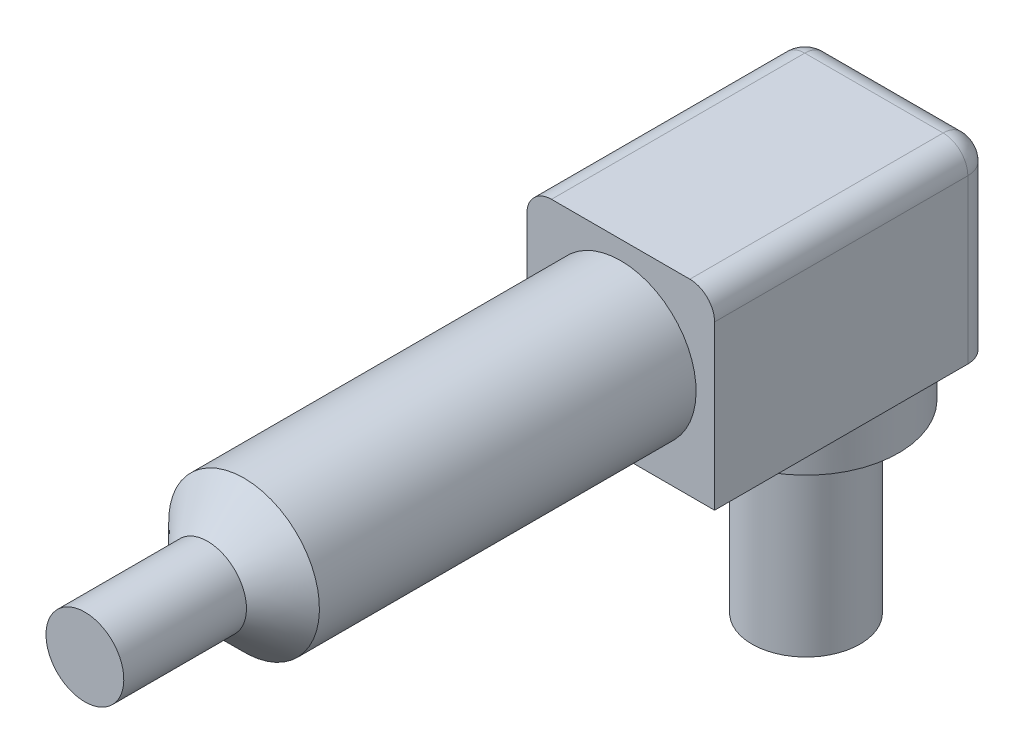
ISO-10303-21;
HEADER;
FILE_DESCRIPTION(('STEP AP214'),'2;1');
FILE_NAME('part.step','',(''),(''),'','','');
FILE_SCHEMA(('AUTOMOTIVE_DESIGN { 1 0 10303 214 1 1 1 1 }'));
ENDSEC;
DATA;
#1=APPLICATION_CONTEXT('core data for automotive mechanical design processes');
#2=APPLICATION_PROTOCOL_DEFINITION('international standard','automotive_design',2000,#1);
#3=PRODUCT_CONTEXT('',#1,'mechanical');
#4=PRODUCT('Part','Part','',(#3));
#5=PRODUCT_RELATED_PRODUCT_CATEGORY('part','',(#4));
#6=PRODUCT_DEFINITION_FORMATION('','',#4);
#7=PRODUCT_DEFINITION_CONTEXT('part definition',#1,'design');
#8=PRODUCT_DEFINITION('design','',#6,#7);
#9=PRODUCT_DEFINITION_SHAPE('','',#8);
#10=(LENGTH_UNIT() NAMED_UNIT(*) SI_UNIT(.MILLI.,.METRE.));
#11=(NAMED_UNIT(*) PLANE_ANGLE_UNIT() SI_UNIT($,.RADIAN.));
#12=(NAMED_UNIT(*) SI_UNIT($,.STERADIAN.) SOLID_ANGLE_UNIT());
#13=UNCERTAINTY_MEASURE_WITH_UNIT(LENGTH_MEASURE(1.E-05),#10,'distance_accuracy_value','');
#14=(GEOMETRIC_REPRESENTATION_CONTEXT(3) GLOBAL_UNCERTAINTY_ASSIGNED_CONTEXT((#13)) GLOBAL_UNIT_ASSIGNED_CONTEXT((#10,
#11,#12)) REPRESENTATION_CONTEXT('',''));
#15=CARTESIAN_POINT('',(0.,0.,0.));
#16=DIRECTION('',(0.,0.,1.));
#17=DIRECTION('',(1.,0.,0.));
#18=AXIS2_PLACEMENT_3D('',#15,#16,#17);
#19=CARTESIAN_POINT('',(9.652,-9.652,28.575));
#20=DIRECTION('',(-1.,0.,0.));
#21=DIRECTION('',(0.,0.,1.));
#22=AXIS2_PLACEMENT_3D('',#19,#20,#21);
#23=PLANE('',#22);
#24=DIRECTION('',(0.,0.,-1.));
#25=VECTOR('',#24,1.);
#26=CARTESIAN_POINT('',(9.652,-9.652,28.575));
#27=LINE('',#26,#25);
#28=CARTESIAN_POINT('',(9.652,-9.652,28.575));
#29=VERTEX_POINT('',#28);
#30=CARTESIAN_POINT('',(9.652,-9.652,2.54));
#31=VERTEX_POINT('',#30);
#32=EDGE_CURVE('E125',#29,#31,#27,.T.);
#33=ORIENTED_EDGE('',*,*,#32,.T.);
#34=DIRECTION('',(0.,1.,0.));
#35=VECTOR('',#34,1.);
#36=CARTESIAN_POINT('',(9.652,9.652,2.54));
#37=LINE('',#36,#35);
#38=CARTESIAN_POINT('',(9.652,7.112,2.54));
#39=VERTEX_POINT('',#38);
#40=EDGE_CURVE('E11',#31,#39,#37,.T.);
#41=ORIENTED_EDGE('',*,*,#40,.T.);
#42=DIRECTION('',(0.,0.,-1.));
#43=VECTOR('',#42,1.);
#44=CARTESIAN_POINT('',(9.652,7.112,28.575));
#45=LINE('',#44,#43);
#46=CARTESIAN_POINT('',(9.652,7.112,28.575));
#47=VERTEX_POINT('',#46);
#48=EDGE_CURVE('E43',#39,#47,#45,.F.);
#49=ORIENTED_EDGE('',*,*,#48,.T.);
#50=DIRECTION('',(0.,1.,0.));
#51=VECTOR('',#50,1.);
#52=CARTESIAN_POINT('',(9.652,-9.652,28.575));
#53=LINE('',#52,#51);
#54=EDGE_CURVE('E134',#29,#47,#53,.T.);
#55=ORIENTED_EDGE('',*,*,#54,.F.);
#56=EDGE_LOOP('',(#33,#41,#49,#55));
#57=FACE_BOUND('',#56,.T.);
#58=ADVANCED_FACE('F34',(#57),#23,.F.);
#59=CARTESIAN_POINT('',(-9.652,9.652,28.575));
#60=DIRECTION('',(0.,-1.,0.));
#61=DIRECTION('',(0.,0.,-1.));
#62=AXIS2_PLACEMENT_3D('',#59,#60,#61);
#63=PLANE('',#62);
#64=DIRECTION('',(-1.,0.,0.));
#65=VECTOR('',#64,1.);
#66=CARTESIAN_POINT('',(-9.652,9.652,2.54));
#67=LINE('',#66,#65);
#68=CARTESIAN_POINT('',(7.112,9.652,2.54));
#69=VERTEX_POINT('',#68);
#70=CARTESIAN_POINT('',(-7.112,9.652,2.54));
#71=VERTEX_POINT('',#70);
#72=EDGE_CURVE('E142',#69,#71,#67,.T.);
#73=ORIENTED_EDGE('',*,*,#72,.T.);
#74=DIRECTION('',(0.,0.,-1.));
#75=VECTOR('',#74,1.);
#76=CARTESIAN_POINT('',(-7.112,9.652,28.575));
#77=LINE('',#76,#75);
#78=CARTESIAN_POINT('',(-7.112,9.652,28.575));
#79=VERTEX_POINT('',#78);
#80=EDGE_CURVE('E144',#71,#79,#77,.F.);
#81=ORIENTED_EDGE('',*,*,#80,.T.);
#82=DIRECTION('',(-1.,0.,0.));
#83=VECTOR('',#82,1.);
#84=CARTESIAN_POINT('',(-9.652,9.652,28.575));
#85=LINE('',#84,#83);
#86=CARTESIAN_POINT('',(7.112,9.652,28.575));
#87=VERTEX_POINT('',#86);
#88=EDGE_CURVE('E116',#87,#79,#85,.T.);
#89=ORIENTED_EDGE('',*,*,#88,.F.);
#90=DIRECTION('',(0.,0.,-1.));
#91=VECTOR('',#90,1.);
#92=CARTESIAN_POINT('',(7.112,9.652,28.575));
#93=LINE('',#92,#91);
#94=EDGE_CURVE('E140',#87,#69,#93,.T.);
#95=ORIENTED_EDGE('',*,*,#94,.T.);
#96=EDGE_LOOP('',(#73,#81,#89,#95));
#97=FACE_BOUND('',#96,.T.);
#98=ADVANCED_FACE('F237',(#97),#63,.F.);
#99=CARTESIAN_POINT('',(-9.652,-9.652,28.575));
#100=DIRECTION('',(1.,0.,0.));
#101=DIRECTION('',(0.,0.,-1.));
#102=AXIS2_PLACEMENT_3D('',#99,#100,#101);
#103=PLANE('',#102);
#104=DIRECTION('',(0.,-1.,0.));
#105=VECTOR('',#104,1.);
#106=CARTESIAN_POINT('',(-9.652,-9.652,28.575));
#107=LINE('',#106,#105);
#108=CARTESIAN_POINT('',(-9.652,7.112,28.575));
#109=VERTEX_POINT('',#108);
#110=CARTESIAN_POINT('',(-9.652,-9.652,28.575));
#111=VERTEX_POINT('',#110);
#112=EDGE_CURVE('E103',#109,#111,#107,.T.);
#113=ORIENTED_EDGE('',*,*,#112,.F.);
#114=DIRECTION('',(0.,0.,-1.));
#115=VECTOR('',#114,1.);
#116=CARTESIAN_POINT('',(-9.652,7.112,28.575));
#117=LINE('',#116,#115);
#118=CARTESIAN_POINT('',(-9.652,7.112,2.54));
#119=VERTEX_POINT('',#118);
#120=EDGE_CURVE('E138',#109,#119,#117,.T.);
#121=ORIENTED_EDGE('',*,*,#120,.T.);
#122=DIRECTION('',(0.,-1.,0.));
#123=VECTOR('',#122,1.);
#124=CARTESIAN_POINT('',(-9.652,-9.652,2.54));
#125=LINE('',#124,#123);
#126=CARTESIAN_POINT('',(-9.652,-9.652,2.54));
#127=VERTEX_POINT('',#126);
#128=EDGE_CURVE('E122',#119,#127,#125,.T.);
#129=ORIENTED_EDGE('',*,*,#128,.T.);
#130=DIRECTION('',(0.,0.,-1.));
#131=VECTOR('',#130,1.);
#132=CARTESIAN_POINT('',(-9.652,-9.652,28.575));
#133=LINE('',#132,#131);
#134=EDGE_CURVE('E119',#111,#127,#133,.T.);
#135=ORIENTED_EDGE('',*,*,#134,.F.);
#136=EDGE_LOOP('',(#113,#121,#129,#135));
#137=FACE_BOUND('',#136,.T.);
#138=ADVANCED_FACE('F120',(#137),#103,.F.);
#139=CARTESIAN_POINT('',(-9.652,-9.652,28.575));
#140=DIRECTION('',(0.,1.,0.));
#141=DIRECTION('',(0.,0.,1.));
#142=AXIS2_PLACEMENT_3D('',#139,#140,#141);
#143=PLANE('',#142);
#144=ORIENTED_EDGE('',*,*,#134,.T.);
#145=CARTESIAN_POINT('',(-7.112,-9.652,2.54));
#146=DIRECTION('',(0.,1.,0.));
#147=DIRECTION('',(0.,0.,1.));
#148=AXIS2_PLACEMENT_3D('',#145,#146,#147);
#149=CIRCLE('',#148,2.54);
#150=CARTESIAN_POINT('',(-7.112,-9.652,0.));
#151=VERTEX_POINT('',#150);
#152=EDGE_CURVE('E151',#127,#151,#149,.F.);
#153=ORIENTED_EDGE('',*,*,#152,.T.);
#154=DIRECTION('',(1.,0.,0.));
#155=VECTOR('',#154,1.);
#156=CARTESIAN_POINT('',(-9.652,-9.652,0.));
#157=LINE('',#156,#155);
#158=CARTESIAN_POINT('',(0.,-9.652,0.));
#159=VERTEX_POINT('',#158);
#160=EDGE_CURVE('E133',#151,#159,#157,.T.);
#161=ORIENTED_EDGE('',*,*,#160,.T.);
#162=CARTESIAN_POINT('',(0.,-9.652,9.525));
#163=DIRECTION('',(0.,1.,0.));
#164=DIRECTION('',(0.,0.,1.));
#165=AXIS2_PLACEMENT_3D('',#162,#163,#164);
#166=CIRCLE('',#165,9.525);
#167=EDGE_CURVE('E200',#159,#159,#166,.T.);
#168=ORIENTED_EDGE('',*,*,#167,.T.);
#169=CARTESIAN_POINT('',(7.112,-9.652,0.));
#170=VERTEX_POINT('',#169);
#171=EDGE_CURVE('E135',#159,#170,#157,.T.);
#172=ORIENTED_EDGE('',*,*,#171,.T.);
#173=CARTESIAN_POINT('',(7.112,-9.652,2.54));
#174=DIRECTION('',(0.,1.,0.));
#175=DIRECTION('',(0.,0.,1.));
#176=AXIS2_PLACEMENT_3D('',#173,#174,#175);
#177=CIRCLE('',#176,2.54);
#178=EDGE_CURVE('E149',#170,#31,#177,.F.);
#179=ORIENTED_EDGE('',*,*,#178,.T.);
#180=ORIENTED_EDGE('',*,*,#32,.F.);
#181=DIRECTION('',(1.,0.,0.));
#182=VECTOR('',#181,1.);
#183=CARTESIAN_POINT('',(-9.652,-9.652,28.575));
#184=LINE('',#183,#182);
#185=EDGE_CURVE('E109',#111,#29,#184,.T.);
#186=ORIENTED_EDGE('',*,*,#185,.F.);
#187=EDGE_LOOP('',(#144,#153,#161,#168,#172,#179,#180,#186));
#188=FACE_BOUND('',#187,.T.);
#189=ADVANCED_FACE('F127',(#188),#143,.F.);
#190=CARTESIAN_POINT('',(0.,0.,28.575));
#191=DIRECTION('',(0.,0.,-1.));
#192=DIRECTION('',(-1.,0.,0.));
#193=AXIS2_PLACEMENT_3D('',#190,#191,#192);
#194=PLANE('',#193);
#195=CARTESIAN_POINT('',(0.,0.,28.575));
#196=DIRECTION('',(0.,0.,-1.));
#197=DIRECTION('',(0.,1.,0.));
#198=AXIS2_PLACEMENT_3D('',#195,#196,#197);
#199=CIRCLE('',#198,7.74999999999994);
#200=CARTESIAN_POINT('',(0.,7.75,28.575));
#201=VERTEX_POINT('',#200);
#202=EDGE_CURVE('E188',#201,#201,#199,.T.);
#203=ORIENTED_EDGE('',*,*,#202,.T.);
#204=EDGE_LOOP('',(#203));
#205=FACE_BOUND('',#204,.T.);
#206=ORIENTED_EDGE('',*,*,#88,.T.);
#207=CARTESIAN_POINT('',(-7.112,7.112,28.575));
#208=DIRECTION('',(0.,0.,-1.));
#209=DIRECTION('',(-1.,0.,0.));
#210=AXIS2_PLACEMENT_3D('',#207,#208,#209);
#211=CIRCLE('',#210,2.54);
#212=EDGE_CURVE('E112',#79,#109,#211,.F.);
#213=ORIENTED_EDGE('',*,*,#212,.T.);
#214=ORIENTED_EDGE('',*,*,#112,.T.);
#215=ORIENTED_EDGE('',*,*,#185,.T.);
#216=ORIENTED_EDGE('',*,*,#54,.T.);
#217=CARTESIAN_POINT('',(7.112,7.112,28.575));
#218=DIRECTION('',(0.,0.,-1.));
#219=DIRECTION('',(-1.,0.,0.));
#220=AXIS2_PLACEMENT_3D('',#217,#218,#219);
#221=CIRCLE('',#220,2.54);
#222=EDGE_CURVE('E146',#47,#87,#221,.F.);
#223=ORIENTED_EDGE('',*,*,#222,.T.);
#224=EDGE_LOOP('',(#206,#213,#214,#215,#216,#223));
#225=FACE_BOUND('',#224,.T.);
#226=ADVANCED_FACE('F106',(#205,#225),#194,.F.);
#227=CARTESIAN_POINT('',(0.,0.,0.));
#228=DIRECTION('',(0.,0.,-1.));
#229=DIRECTION('',(-1.,0.,0.));
#230=AXIS2_PLACEMENT_3D('',#227,#228,#229);
#231=PLANE('',#230);
#232=ORIENTED_EDGE('',*,*,#160,.F.);
#233=DIRECTION('',(0.,-1.,0.));
#234=VECTOR('',#233,1.);
#235=CARTESIAN_POINT('',(-7.112,9.652,0.));
#236=LINE('',#235,#234);
#237=CARTESIAN_POINT('',(-7.112,7.112,0.));
#238=VERTEX_POINT('',#237);
#239=EDGE_CURVE('E57',#151,#238,#236,.F.);
#240=ORIENTED_EDGE('',*,*,#239,.T.);
#241=DIRECTION('',(-1.,0.,0.));
#242=VECTOR('',#241,1.);
#243=CARTESIAN_POINT('',(9.652,7.112,0.));
#244=LINE('',#243,#242);
#245=CARTESIAN_POINT('',(7.112,7.112,0.));
#246=VERTEX_POINT('',#245);
#247=EDGE_CURVE('E155',#238,#246,#244,.F.);
#248=ORIENTED_EDGE('',*,*,#247,.T.);
#249=DIRECTION('',(0.,1.,0.));
#250=VECTOR('',#249,1.);
#251=CARTESIAN_POINT('',(7.112,-9.652,0.));
#252=LINE('',#251,#250);
#253=EDGE_CURVE('E153',#246,#170,#252,.F.);
#254=ORIENTED_EDGE('',*,*,#253,.T.);
#255=ORIENTED_EDGE('',*,*,#171,.F.);
#256=EDGE_LOOP('',(#232,#240,#248,#254,#255));
#257=FACE_BOUND('',#256,.T.);
#258=ADVANCED_FACE('F219',(#257),#231,.T.);
#259=CARTESIAN_POINT('',(0.,-9.652,9.525));
#260=DIRECTION('',(0.,1.,0.));
#261=DIRECTION('',(0.,0.,1.));
#262=AXIS2_PLACEMENT_3D('',#259,#260,#261);
#263=CYLINDRICAL_SURFACE('',#262,9.525);
#264=ORIENTED_EDGE('',*,*,#167,.F.);
#265=EDGE_LOOP('',(#264));
#266=FACE_BOUND('',#265,.T.);
#267=CARTESIAN_POINT('',(0.,-14.148,9.525));
#268=DIRECTION('',(0.,1.,0.));
#269=DIRECTION('',(0.,0.,1.));
#270=AXIS2_PLACEMENT_3D('',#267,#268,#269);
#271=CIRCLE('',#270,9.525);
#272=CARTESIAN_POINT('',(0.,-14.148,19.05));
#273=VERTEX_POINT('',#272);
#274=EDGE_CURVE('E197',#273,#273,#271,.T.);
#275=ORIENTED_EDGE('',*,*,#274,.T.);
#276=EDGE_LOOP('',(#275));
#277=FACE_BOUND('',#276,.T.);
#278=ADVANCED_FACE('F357',(#266,#277),#263,.T.);
#279=CARTESIAN_POINT('',(0.,-14.148,0.));
#280=DIRECTION('',(0.,1.,0.));
#281=DIRECTION('',(0.,0.,1.));
#282=AXIS2_PLACEMENT_3D('',#279,#280,#281);
#283=PLANE('',#282);
#284=ORIENTED_EDGE('',*,*,#274,.F.);
#285=EDGE_LOOP('',(#284));
#286=FACE_BOUND('',#285,.T.);
#287=CARTESIAN_POINT('',(0.,-14.148,9.525));
#288=DIRECTION('',(0.,1.,0.));
#289=DIRECTION('',(0.,0.,1.));
#290=AXIS2_PLACEMENT_3D('',#287,#288,#289);
#291=CIRCLE('',#290,5.55625);
#292=CARTESIAN_POINT('',(0.,-14.148,15.08125));
#293=VERTEX_POINT('',#292);
#294=EDGE_CURVE('E194',#293,#293,#291,.T.);
#295=ORIENTED_EDGE('',*,*,#294,.T.);
#296=EDGE_LOOP('',(#295));
#297=FACE_BOUND('',#296,.T.);
#298=ADVANCED_FACE('F347',(#286,#297),#283,.F.);
#299=CARTESIAN_POINT('',(0.,-9.652,9.525));
#300=DIRECTION('',(0.,1.,0.));
#301=DIRECTION('',(0.,0.,1.));
#302=AXIS2_PLACEMENT_3D('',#299,#300,#301);
#303=CYLINDRICAL_SURFACE('',#302,5.55625);
#304=ORIENTED_EDGE('',*,*,#294,.F.);
#305=EDGE_LOOP('',(#304));
#306=FACE_BOUND('',#305,.T.);
#307=CARTESIAN_POINT('',(0.,-33.148,9.525));
#308=DIRECTION('',(0.,1.,0.));
#309=DIRECTION('',(0.,0.,1.));
#310=AXIS2_PLACEMENT_3D('',#307,#308,#309);
#311=CIRCLE('',#310,5.55625);
#312=CARTESIAN_POINT('',(0.,-33.148,15.08125));
#313=VERTEX_POINT('',#312);
#314=EDGE_CURVE('E191',#313,#313,#311,.T.);
#315=ORIENTED_EDGE('',*,*,#314,.T.);
#316=EDGE_LOOP('',(#315));
#317=FACE_BOUND('',#316,.T.);
#318=ADVANCED_FACE('F337',(#306,#317),#303,.T.);
#319=CARTESIAN_POINT('',(0.,-33.148,3.96875));
#320=DIRECTION('',(0.,1.,0.));
#321=DIRECTION('',(0.,0.,1.));
#322=AXIS2_PLACEMENT_3D('',#319,#320,#321);
#323=PLANE('',#322);
#324=ORIENTED_EDGE('',*,*,#314,.F.);
#325=EDGE_LOOP('',(#324));
#326=FACE_BOUND('',#325,.T.);
#327=ADVANCED_FACE('F325',(#326),#323,.F.);
#328=CARTESIAN_POINT('',(0.,0.,0.));
#329=DIRECTION('',(0.,0.,-1.));
#330=DIRECTION('',(0.,1.,0.));
#331=AXIS2_PLACEMENT_3D('',#328,#329,#330);
#332=CYLINDRICAL_SURFACE('',#331,7.74999999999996);
#333=CARTESIAN_POINT('',(0.,0.,67.3));
#334=DIRECTION('',(0.,0.,-1.));
#335=DIRECTION('',(0.,1.,0.));
#336=AXIS2_PLACEMENT_3D('',#333,#334,#335);
#337=CIRCLE('',#336,7.74999999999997);
#338=CARTESIAN_POINT('',(0.,7.74999999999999,67.3));
#339=VERTEX_POINT('',#338);
#340=EDGE_CURVE('E183',#339,#339,#337,.T.);
#341=ORIENTED_EDGE('',*,*,#340,.T.);
#342=EDGE_LOOP('',(#341));
#343=FACE_BOUND('',#342,.T.);
#344=ORIENTED_EDGE('',*,*,#202,.F.);
#345=EDGE_LOOP('',(#344));
#346=FACE_BOUND('',#345,.T.);
#347=ADVANCED_FACE('F316',(#343,#346),#332,.T.);
#348=CARTESIAN_POINT('',(0.,0.,67.3));
#349=DIRECTION('',(0.,0.,-1.));
#350=DIRECTION('',(0.,1.,0.));
#351=AXIS2_PLACEMENT_3D('',#348,#349,#350);
#352=CONICAL_SURFACE('',#351,7.74999999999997,0.785398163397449);
#353=CARTESIAN_POINT('',(0.,0.,71.05));
#354=DIRECTION('',(0.,0.,-1.));
#355=DIRECTION('',(0.,1.,0.));
#356=AXIS2_PLACEMENT_3D('',#353,#354,#355);
#357=CIRCLE('',#356,3.99999999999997);
#358=CARTESIAN_POINT('',(0.,3.99999999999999,71.05));
#359=VERTEX_POINT('',#358);
#360=EDGE_CURVE('E178',#359,#359,#357,.T.);
#361=ORIENTED_EDGE('',*,*,#360,.T.);
#362=EDGE_LOOP('',(#361));
#363=FACE_BOUND('',#362,.T.);
#364=ORIENTED_EDGE('',*,*,#340,.F.);
#365=EDGE_LOOP('',(#364));
#366=FACE_BOUND('',#365,.T.);
#367=ADVANCED_FACE('F308',(#363,#366),#352,.T.);
#368=CARTESIAN_POINT('',(0.,0.,0.));
#369=DIRECTION('',(0.,0.,-1.));
#370=DIRECTION('',(0.,1.,0.));
#371=AXIS2_PLACEMENT_3D('',#368,#369,#370);
#372=CYLINDRICAL_SURFACE('',#371,3.99999999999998);
#373=CARTESIAN_POINT('',(0.,0.,83.6612133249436));
#374=DIRECTION('',(0.,0.,-1.));
#375=DIRECTION('',(0.,1.,0.));
#376=AXIS2_PLACEMENT_3D('',#373,#374,#375);
#377=CIRCLE('',#376,3.99999999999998);
#378=CARTESIAN_POINT('',(0.,3.99999999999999,83.6612133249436));
#379=VERTEX_POINT('',#378);
#380=EDGE_CURVE('E175',#379,#379,#377,.T.);
#381=ORIENTED_EDGE('',*,*,#380,.T.);
#382=EDGE_LOOP('',(#381));
#383=FACE_BOUND('',#382,.T.);
#384=ORIENTED_EDGE('',*,*,#360,.F.);
#385=EDGE_LOOP('',(#384));
#386=FACE_BOUND('',#385,.T.);
#387=ADVANCED_FACE('F233',(#383,#386),#372,.T.);
#388=CARTESIAN_POINT('',(0.,3.99999999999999,83.6612133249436));
#389=DIRECTION('',(0.,0.,1.));
#390=DIRECTION('',(0.,-1.,0.));
#391=AXIS2_PLACEMENT_3D('',#388,#389,#390);
#392=PLANE('',#391);
#393=ORIENTED_EDGE('',*,*,#380,.F.);
#394=EDGE_LOOP('',(#393));
#395=FACE_BOUND('',#394,.T.);
#396=ADVANCED_FACE('F226',(#395),#392,.T.);
#397=CARTESIAN_POINT('',(7.112,-9.652,2.54));
#398=DIRECTION('',(0.,-1.,0.));
#399=DIRECTION('',(0.,0.,-1.));
#400=AXIS2_PLACEMENT_3D('',#397,#398,#399);
#401=CYLINDRICAL_SURFACE('',#400,2.54);
#402=ORIENTED_EDGE('',*,*,#178,.F.);
#403=ORIENTED_EDGE('',*,*,#253,.F.);
#404=CARTESIAN_POINT('',(7.112,7.112,2.54));
#405=DIRECTION('',(0.,1.,0.));
#406=DIRECTION('',(0.,0.,1.));
#407=AXIS2_PLACEMENT_3D('',#404,#405,#406);
#408=CIRCLE('',#407,2.54);
#409=EDGE_CURVE('E38',#39,#246,#408,.T.);
#410=ORIENTED_EDGE('',*,*,#409,.F.);
#411=ORIENTED_EDGE('',*,*,#40,.F.);
#412=EDGE_LOOP('',(#402,#403,#410,#411));
#413=FACE_BOUND('',#412,.T.);
#414=ADVANCED_FACE('F36',(#413),#401,.T.);
#415=CARTESIAN_POINT('',(7.112,7.112,28.575));
#416=DIRECTION('',(0.,0.,-1.));
#417=DIRECTION('',(-1.,0.,0.));
#418=AXIS2_PLACEMENT_3D('',#415,#416,#417);
#419=CYLINDRICAL_SURFACE('',#418,2.54);
#420=ORIENTED_EDGE('',*,*,#222,.F.);
#421=ORIENTED_EDGE('',*,*,#48,.F.);
#422=CARTESIAN_POINT('',(7.112,7.112,2.54));
#423=DIRECTION('',(0.,0.,-1.));
#424=DIRECTION('',(-1.,0.,0.));
#425=AXIS2_PLACEMENT_3D('',#422,#423,#424);
#426=CIRCLE('',#425,2.54);
#427=EDGE_CURVE('E169',#69,#39,#426,.T.);
#428=ORIENTED_EDGE('',*,*,#427,.F.);
#429=ORIENTED_EDGE('',*,*,#94,.F.);
#430=EDGE_LOOP('',(#420,#421,#428,#429));
#431=FACE_BOUND('',#430,.T.);
#432=ADVANCED_FACE('F225',(#431),#419,.T.);
#433=CARTESIAN_POINT('',(7.112,7.112,2.54));
#434=DIRECTION('',(0.,0.,1.));
#435=DIRECTION('',(1.,0.,0.));
#436=AXIS2_PLACEMENT_3D('',#433,#434,#435);
#437=SPHERICAL_SURFACE('',#436,2.54);
#438=ORIENTED_EDGE('',*,*,#427,.T.);
#439=ORIENTED_EDGE('',*,*,#409,.T.);
#440=CARTESIAN_POINT('',(7.112,7.112,2.54));
#441=DIRECTION('',(1.,0.,0.));
#442=DIRECTION('',(0.,0.,-1.));
#443=AXIS2_PLACEMENT_3D('',#440,#441,#442);
#444=CIRCLE('',#443,2.54);
#445=EDGE_CURVE('E167',#69,#246,#444,.F.);
#446=ORIENTED_EDGE('',*,*,#445,.F.);
#447=EDGE_LOOP('',(#438,#439,#446));
#448=FACE_BOUND('',#447,.T.);
#449=ADVANCED_FACE('F231',(#448),#437,.T.);
#450=CARTESIAN_POINT('',(-7.112,-9.652,2.54));
#451=DIRECTION('',(0.,1.,0.));
#452=DIRECTION('',(0.,0.,1.));
#453=AXIS2_PLACEMENT_3D('',#450,#451,#452);
#454=CYLINDRICAL_SURFACE('',#453,2.54);
#455=ORIENTED_EDGE('',*,*,#152,.F.);
#456=ORIENTED_EDGE('',*,*,#128,.F.);
#457=CARTESIAN_POINT('',(-7.112,7.112,2.54));
#458=DIRECTION('',(0.,1.,0.));
#459=DIRECTION('',(0.,0.,1.));
#460=AXIS2_PLACEMENT_3D('',#457,#458,#459);
#461=CIRCLE('',#460,2.54);
#462=EDGE_CURVE('E164',#238,#119,#461,.T.);
#463=ORIENTED_EDGE('',*,*,#462,.F.);
#464=ORIENTED_EDGE('',*,*,#239,.F.);
#465=EDGE_LOOP('',(#455,#456,#463,#464));
#466=FACE_BOUND('',#465,.T.);
#467=ADVANCED_FACE('F216',(#466),#454,.T.);
#468=CARTESIAN_POINT('',(-9.652,7.112,2.54));
#469=DIRECTION('',(1.,0.,0.));
#470=DIRECTION('',(0.,0.,-1.));
#471=AXIS2_PLACEMENT_3D('',#468,#469,#470);
#472=CYLINDRICAL_SURFACE('',#471,2.54);
#473=ORIENTED_EDGE('',*,*,#445,.T.);
#474=ORIENTED_EDGE('',*,*,#247,.F.);
#475=CARTESIAN_POINT('',(-7.112,7.112,2.54));
#476=DIRECTION('',(-1.,0.,0.));
#477=DIRECTION('',(0.,0.,1.));
#478=AXIS2_PLACEMENT_3D('',#475,#476,#477);
#479=CIRCLE('',#478,2.54);
#480=EDGE_CURVE('E161',#71,#238,#479,.T.);
#481=ORIENTED_EDGE('',*,*,#480,.F.);
#482=ORIENTED_EDGE('',*,*,#72,.F.);
#483=EDGE_LOOP('',(#473,#474,#481,#482));
#484=FACE_BOUND('',#483,.T.);
#485=ADVANCED_FACE('F249',(#484),#472,.T.);
#486=CARTESIAN_POINT('',(-7.112,7.112,2.54));
#487=DIRECTION('',(0.,0.,1.));
#488=DIRECTION('',(1.,0.,0.));
#489=AXIS2_PLACEMENT_3D('',#486,#487,#488);
#490=SPHERICAL_SURFACE('',#489,2.54);
#491=ORIENTED_EDGE('',*,*,#480,.T.);
#492=ORIENTED_EDGE('',*,*,#462,.T.);
#493=CARTESIAN_POINT('',(-7.112,7.112,2.54));
#494=DIRECTION('',(0.,0.,-1.));
#495=DIRECTION('',(-1.,0.,0.));
#496=AXIS2_PLACEMENT_3D('',#493,#494,#495);
#497=CIRCLE('',#496,2.54);
#498=EDGE_CURVE('E159',#71,#119,#497,.F.);
#499=ORIENTED_EDGE('',*,*,#498,.F.);
#500=EDGE_LOOP('',(#491,#492,#499));
#501=FACE_BOUND('',#500,.T.);
#502=ADVANCED_FACE('F213',(#501),#490,.T.);
#503=CARTESIAN_POINT('',(-7.112,7.112,28.575));
#504=DIRECTION('',(0.,0.,-1.));
#505=DIRECTION('',(-1.,0.,0.));
#506=AXIS2_PLACEMENT_3D('',#503,#504,#505);
#507=CYLINDRICAL_SURFACE('',#506,2.54);
#508=ORIENTED_EDGE('',*,*,#212,.F.);
#509=ORIENTED_EDGE('',*,*,#80,.F.);
#510=ORIENTED_EDGE('',*,*,#498,.T.);
#511=ORIENTED_EDGE('',*,*,#120,.F.);
#512=EDGE_LOOP('',(#508,#509,#510,#511));
#513=FACE_BOUND('',#512,.T.);
#514=ADVANCED_FACE('F209',(#513),#507,.T.);
#515=CLOSED_SHELL('',(#58,#98,#138,#189,#226,#258,#278,#298,#318,#327,#347,#367,#387,#396,#414,
#432,#449,#467,#485,#502,#514));
#516=MANIFOLD_SOLID_BREP('B2',#515);
#517=ADVANCED_BREP_SHAPE_REPRESENTATION('',(#18,#516),#14);
#518=SHAPE_DEFINITION_REPRESENTATION(#9,#517);
ENDSEC;
END-ISO-10303-21;
